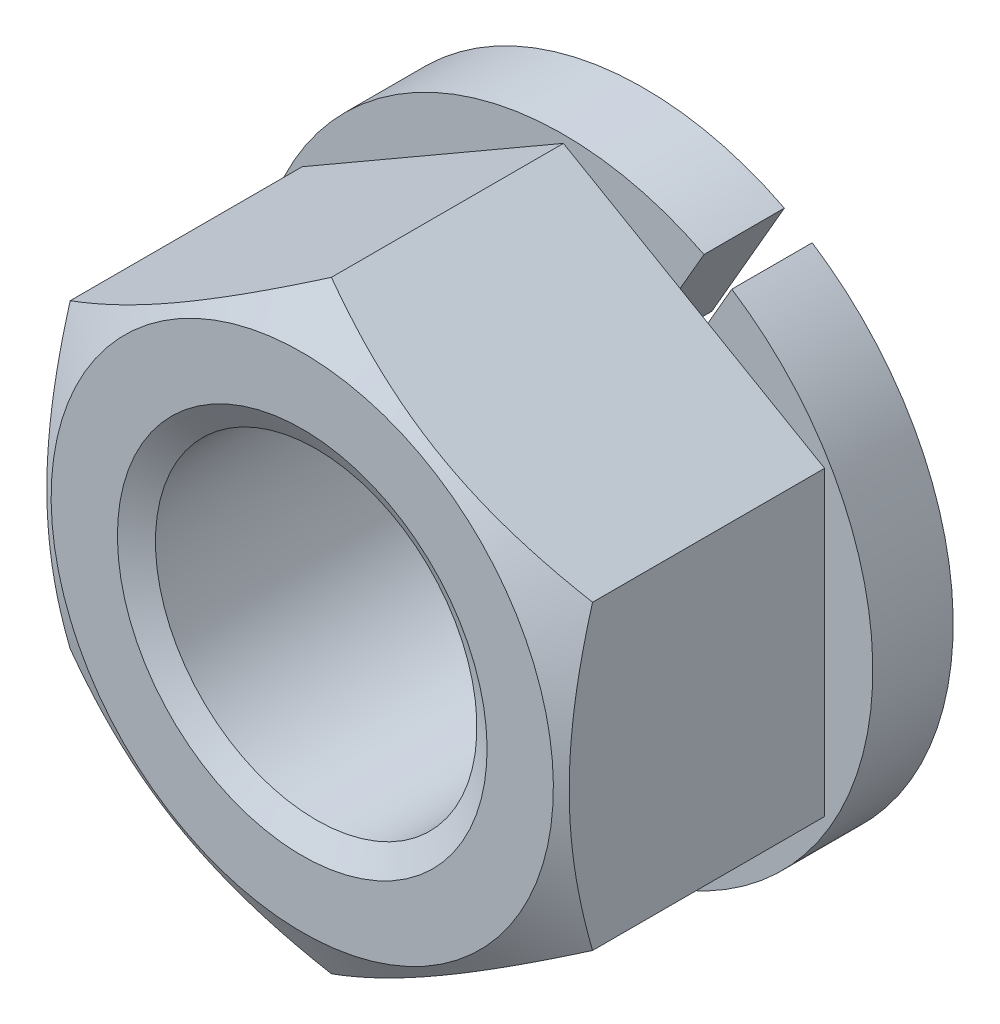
ISO-10303-21;
HEADER;
FILE_DESCRIPTION(('STEP AP214'),'2;1');
FILE_NAME('part.step','',(''),(''),'','','');
FILE_SCHEMA(('AUTOMOTIVE_DESIGN { 1 0 10303 214 1 1 1 1 }'));
ENDSEC;
DATA;
#1=APPLICATION_CONTEXT('core data for automotive mechanical design processes');
#2=APPLICATION_PROTOCOL_DEFINITION('international standard','automotive_design',2000,#1);
#3=PRODUCT_CONTEXT('',#1,'mechanical');
#4=PRODUCT('Part','Part','',(#3));
#5=PRODUCT_RELATED_PRODUCT_CATEGORY('part','',(#4));
#6=PRODUCT_DEFINITION_FORMATION('','',#4);
#7=PRODUCT_DEFINITION_CONTEXT('part definition',#1,'design');
#8=PRODUCT_DEFINITION('design','',#6,#7);
#9=PRODUCT_DEFINITION_SHAPE('','',#8);
#10=(LENGTH_UNIT() NAMED_UNIT(*) SI_UNIT(.MILLI.,.METRE.));
#11=(NAMED_UNIT(*) PLANE_ANGLE_UNIT() SI_UNIT($,.RADIAN.));
#12=(NAMED_UNIT(*) SI_UNIT($,.STERADIAN.) SOLID_ANGLE_UNIT());
#13=UNCERTAINTY_MEASURE_WITH_UNIT(LENGTH_MEASURE(1.E-05),#10,'distance_accuracy_value','');
#14=(GEOMETRIC_REPRESENTATION_CONTEXT(3) GLOBAL_UNCERTAINTY_ASSIGNED_CONTEXT((#13)) GLOBAL_UNIT_ASSIGNED_CONTEXT((#10,
#11,#12)) REPRESENTATION_CONTEXT('',''));
#15=CARTESIAN_POINT('',(0.,0.,0.));
#16=DIRECTION('',(0.,0.,1.));
#17=DIRECTION('',(1.,0.,0.));
#18=AXIS2_PLACEMENT_3D('',#15,#16,#17);
#19=CARTESIAN_POINT('',(13.,0.,2.));
#20=DIRECTION('',(0.,0.,1.));
#21=DIRECTION('',(-0.866025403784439,0.5,0.));
#22=AXIS2_PLACEMENT_3D('',#19,#20,#21);
#23=PLANE('',#22);
#24=CARTESIAN_POINT('',(0.,0.,2.));
#25=DIRECTION('',(0.,0.,1.));
#26=DIRECTION('',(0.866025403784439,-0.5,0.));
#27=AXIS2_PLACEMENT_3D('',#24,#25,#26);
#28=CIRCLE('',#27,4.);
#29=CARTESIAN_POINT('',(3.46410161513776,-2.,2.));
#30=VERTEX_POINT('',#29);
#31=EDGE_CURVE('E125',#30,#30,#28,.T.);
#32=ORIENTED_EDGE('',*,*,#31,.T.);
#33=EDGE_LOOP('',(#32));
#34=FACE_BOUND('',#33,.T.);
#35=DIRECTION('',(0.5,0.866025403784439,0.));
#36=VECTOR('',#35,1.);
#37=CARTESIAN_POINT('',(2.38663073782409,3.33376569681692,2.));
#38=LINE('',#37,#36);
#39=CARTESIAN_POINT('',(2.38663073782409,3.33376569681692,2.));
#40=VERTEX_POINT('',#39);
#41=CARTESIAN_POINT('',(3.59641016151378,5.42916512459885,2.));
#42=VERTEX_POINT('',#41);
#43=EDGE_CURVE('E9',#40,#42,#38,.T.);
#44=ORIENTED_EDGE('',*,*,#43,.F.);
#45=CARTESIAN_POINT('',(0.,0.,2.));
#46=DIRECTION('',(0.,0.,1.));
#47=DIRECTION('',(-0.866025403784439,0.5,0.));
#48=AXIS2_PLACEMENT_3D('',#45,#46,#47);
#49=CIRCLE('',#48,4.1);
#50=CARTESIAN_POINT('',(1.69381041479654,3.73376569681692,2.));
#51=VERTEX_POINT('',#50);
#52=EDGE_CURVE('E24',#51,#40,#49,.T.);
#53=ORIENTED_EDGE('',*,*,#52,.F.);
#54=DIRECTION('',(-0.5,-0.866025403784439,0.));
#55=VECTOR('',#54,1.);
#56=CARTESIAN_POINT('',(1.69381041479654,3.73376569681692,2.));
#57=LINE('',#56,#55);
#58=CARTESIAN_POINT('',(2.90358983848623,5.82916512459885,2.));
#59=VERTEX_POINT('',#58);
#60=EDGE_CURVE('E39',#59,#51,#57,.T.);
#61=ORIENTED_EDGE('',*,*,#60,.F.);
#62=DIRECTION('',(-0.866025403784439,0.5,0.));
#63=VECTOR('',#62,1.);
#64=CARTESIAN_POINT('',(6.5,3.75277674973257,2.));
#65=LINE('',#64,#63);
#66=EDGE_CURVE('E267',#42,#59,#65,.T.);
#67=ORIENTED_EDGE('',*,*,#66,.F.);
#68=EDGE_LOOP('',(#44,#53,#61,#67));
#69=FACE_BOUND('',#68,.T.);
#70=ADVANCED_FACE('F14',(#34,#69),#23,.F.);
#71=CARTESIAN_POINT('',(0.,-7.50555349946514,8.5));
#72=DIRECTION('',(-0.5,0.866025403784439,0.));
#73=DIRECTION('',(-0.866025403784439,-0.5,0.));
#74=AXIS2_PLACEMENT_3D('',#71,#72,#73);
#75=PLANE('',#74);
#76=CARTESIAN_POINT('',(-0.000199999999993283,-7.50566896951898,7.77503918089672));
#77=CARTESIAN_POINT('',(0.142677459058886,-7.4231786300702,7.8226580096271));
#78=CARTESIAN_POINT('',(0.286087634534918,-7.34038072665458,7.86811573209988));
#79=CARTESIAN_POINT('',(0.5740726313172,-7.17411251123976,7.95411375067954));
#80=CARTESIAN_POINT('',(0.718647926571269,-7.09064192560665,7.99465192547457));
#81=CARTESIAN_POINT('',(1.15468865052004,-6.83889369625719,8.10809143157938));
#82=CARTESIAN_POINT('',(1.44787528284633,-6.66962231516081,8.17261462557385));
#83=CARTESIAN_POINT('',(1.88662374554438,-6.41631077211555,8.2482758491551));
#84=CARTESIAN_POINT('',(2.0308746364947,-6.33302748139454,8.2698295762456));
#85=CARTESIAN_POINT('',(2.3200282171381,-6.16608458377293,8.30597211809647));
#86=CARTESIAN_POINT('',(2.4649308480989,-6.08242501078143,8.32056154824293));
#87=CARTESIAN_POINT('',(2.75498777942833,-5.91496056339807,8.34240368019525));
#88=CARTESIAN_POINT('',(2.90014160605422,-5.8311559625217,8.34966470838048));
#89=CARTESIAN_POINT('',(3.19057533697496,-5.66347396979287,8.35670213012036));
#90=CARTESIAN_POINT('',(3.33585523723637,-5.5795965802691,8.35647875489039));
#91=CARTESIAN_POINT('',(3.7338759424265,-5.34979921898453,8.34557897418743));
#92=CARTESIAN_POINT('',(3.98648646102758,-5.20395446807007,8.32728061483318));
#93=CARTESIAN_POINT('',(4.49002967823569,-4.91323365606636,8.26925609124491));
#94=CARTESIAN_POINT('',(4.74096060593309,-4.76835861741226,8.22951009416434));
#95=CARTESIAN_POINT('',(5.24551722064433,-4.47705272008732,8.13015652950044));
#96=CARTESIAN_POINT('',(5.49907924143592,-4.33065861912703,8.07012800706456));
#97=CARTESIAN_POINT('',(6.00242193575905,-4.04005357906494,7.93388744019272));
#98=CARTESIAN_POINT('',(6.25220905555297,-3.89583891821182,7.85770739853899));
#99=CARTESIAN_POINT('',(6.5002,-3.75266127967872,7.77503918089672));
#100=B_SPLINE_CURVE_WITH_KNOTS('',3,(#76,#77,#78,#79,#80,#81,#82,#83,#84,#85,#86,#87,#88,#89,
#90,#91,#92,#93,#94,#95,#96,#97,#98,#99),.UNSPECIFIED.,.F.,.F.,(4,2,2,2,2,2,2,2,2,2,2,4),(0.,
0.515105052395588,1.03043143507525,2.06322554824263,2.56697389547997,3.07067772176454,
3.57380860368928,4.07692394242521,4.95279354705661,5.82947446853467,6.72559912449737,
7.61996451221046),.UNSPECIFIED.);
#101=CARTESIAN_POINT('',(0.,-7.50555349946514,7.77510584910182));
#102=VERTEX_POINT('',#101);
#103=CARTESIAN_POINT('',(6.5,-3.75277674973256,7.77510584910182));
#104=VERTEX_POINT('',#103);
#105=EDGE_CURVE('E204',#102,#104,#100,.T.);
#106=ORIENTED_EDGE('',*,*,#105,.F.);
#107=DIRECTION('',(0.,0.,-1.));
#108=VECTOR('',#107,1.);
#109=CARTESIAN_POINT('',(0.,-7.50555349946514,8.5));
#110=LINE('',#109,#108);
#111=CARTESIAN_POINT('',(0.,-7.50555349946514,2.));
#112=VERTEX_POINT('',#111);
#113=EDGE_CURVE('E278',#102,#112,#110,.T.);
#114=ORIENTED_EDGE('',*,*,#113,.T.);
#115=DIRECTION('',(0.866025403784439,0.5,0.));
#116=VECTOR('',#115,1.);
#117=CARTESIAN_POINT('',(0.,-7.50555349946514,2.));
#118=LINE('',#117,#116);
#119=CARTESIAN_POINT('',(6.5,-3.75277674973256,2.));
#120=VERTEX_POINT('',#119);
#121=EDGE_CURVE('E298',#112,#120,#118,.T.);
#122=ORIENTED_EDGE('',*,*,#121,.T.);
#123=DIRECTION('',(0.,0.,-1.));
#124=VECTOR('',#123,1.);
#125=CARTESIAN_POINT('',(6.5,-3.75277674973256,8.5));
#126=LINE('',#125,#124);
#127=EDGE_CURVE('E291',#104,#120,#126,.T.);
#128=ORIENTED_EDGE('',*,*,#127,.F.);
#129=EDGE_LOOP('',(#106,#114,#122,#128));
#130=FACE_BOUND('',#129,.T.);
#131=ADVANCED_FACE('F16',(#130),#75,.F.);
#132=CARTESIAN_POINT('',(6.5,-3.75277674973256,8.5));
#133=DIRECTION('',(-1.,0.,0.));
#134=DIRECTION('',(0.,-1.,0.));
#135=AXIS2_PLACEMENT_3D('',#132,#133,#134);
#136=PLANE('',#135);
#137=CARTESIAN_POINT('',(6.5,-3.75300768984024,7.77503918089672));
#138=CARTESIAN_POINT('',(6.5,-3.58802701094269,7.8226580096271));
#139=CARTESIAN_POINT('',(6.5,-3.42243120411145,7.86811573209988));
#140=CARTESIAN_POINT('',(6.5,-3.08989477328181,7.95411375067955));
#141=CARTESIAN_POINT('',(6.5,-2.92295360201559,7.99465192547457));
#142=CARTESIAN_POINT('',(6.5,-2.41945714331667,8.10809143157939));
#143=CARTESIAN_POINT('',(6.5,-2.08091438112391,8.17261462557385));
#144=CARTESIAN_POINT('',(6.5,-1.5742912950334,8.2482758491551));
#145=CARTESIAN_POINT('',(6.5,-1.40772471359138,8.26982957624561));
#146=CARTESIAN_POINT('',(6.5,-1.07383891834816,8.30597211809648));
#147=CARTESIAN_POINT('',(6.5,-0.906519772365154,8.32056154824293));
#148=CARTESIAN_POINT('',(6.5,-0.571590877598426,8.34240368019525));
#149=CARTESIAN_POINT('',(6.5,-0.403981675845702,8.34966470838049));
#150=CARTESIAN_POINT('',(6.5,-0.0686176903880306,8.35670213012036));
#151=CARTESIAN_POINT('',(6.5,0.099137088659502,8.35647875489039));
#152=CARTESIAN_POINT('',(6.5,0.558731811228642,8.34557897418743));
#153=CARTESIAN_POINT('',(6.5,0.850421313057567,8.32728061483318));
#154=CARTESIAN_POINT('',(6.5,1.43186293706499,8.26925609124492));
#155=CARTESIAN_POINT('',(6.5,1.72161301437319,8.22951009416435));
#156=CARTESIAN_POINT('',(6.5,2.30422480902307,8.13015652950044));
#157=CARTESIAN_POINT('',(6.5,2.59701301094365,8.07012800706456));
#158=CARTESIAN_POINT('',(6.5,3.17822309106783,7.93388744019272));
#159=CARTESIAN_POINT('',(6.5,3.46665241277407,7.857707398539));
#160=CARTESIAN_POINT('',(6.5,3.75300768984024,7.77503918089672));
#161=B_SPLINE_CURVE_WITH_KNOTS('',3,(#137,#138,#139,#140,#141,#142,#143,#144,#145,#146,#147,
#148,#149,#150,#151,#152,#153,#154,#155,#156,#157,#158,#159,#160),.UNSPECIFIED.,.F.,.F.,(4,2,2,
2,2,2,2,2,2,2,2,4),(0.,0.515105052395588,1.03043143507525,2.06322554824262,2.56697389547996,
3.07067772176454,3.57380860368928,4.0769239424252,4.9527935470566,5.82947446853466,
6.72559912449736,7.61996451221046),.UNSPECIFIED.);
#162=CARTESIAN_POINT('',(6.5,3.75277674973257,7.77510584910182));
#163=VERTEX_POINT('',#162);
#164=EDGE_CURVE('E198',#104,#163,#161,.T.);
#165=ORIENTED_EDGE('',*,*,#164,.F.);
#166=ORIENTED_EDGE('',*,*,#127,.T.);
#167=DIRECTION('',(0.,1.,0.));
#168=VECTOR('',#167,1.);
#169=CARTESIAN_POINT('',(6.5,-3.75277674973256,2.));
#170=LINE('',#169,#168);
#171=CARTESIAN_POINT('',(6.5,3.75277674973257,2.));
#172=VERTEX_POINT('',#171);
#173=EDGE_CURVE('E270',#120,#172,#170,.T.);
#174=ORIENTED_EDGE('',*,*,#173,.T.);
#175=DIRECTION('',(0.,0.,-1.));
#176=VECTOR('',#175,1.);
#177=CARTESIAN_POINT('',(6.5,3.75277674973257,8.5));
#178=LINE('',#177,#176);
#179=EDGE_CURVE('E290',#163,#172,#178,.T.);
#180=ORIENTED_EDGE('',*,*,#179,.F.);
#181=EDGE_LOOP('',(#165,#166,#174,#180));
#182=FACE_BOUND('',#181,.T.);
#183=ADVANCED_FACE('F210',(#182),#136,.F.);
#184=CARTESIAN_POINT('',(6.5,3.75277674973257,8.5));
#185=DIRECTION('',(-0.5,-0.866025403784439,0.));
#186=DIRECTION('',(0.866025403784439,-0.5,0.));
#187=AXIS2_PLACEMENT_3D('',#184,#185,#186);
#188=PLANE('',#187);
#189=CARTESIAN_POINT('',(12.0032073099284,0.575498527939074,5.17042351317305));
#190=CARTESIAN_POINT('',(11.7571068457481,0.717584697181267,5.3083805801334));
#191=CARTESIAN_POINT('',(11.5104438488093,0.859995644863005,5.4450224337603));
#192=CARTESIAN_POINT('',(11.0156936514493,1.14563980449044,5.71493638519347));
#193=CARTESIAN_POINT('',(10.7676062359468,1.28887314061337,5.8482079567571));
#194=CARTESIAN_POINT('',(10.2684414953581,1.57706603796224,6.11130647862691));
#195=CARTESIAN_POINT('',(10.0173552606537,1.7220307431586,6.24111096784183));
#196=CARTESIAN_POINT('',(9.5131933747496,2.01310874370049,6.49544224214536));
#197=CARTESIAN_POINT('',(9.2601178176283,2.15922198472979,6.61996927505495));
#198=CARTESIAN_POINT('',(8.74340270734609,2.45754759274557,6.86624792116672));
#199=CARTESIAN_POINT('',(8.47968493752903,2.60980511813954,6.98778190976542));
#200=CARTESIAN_POINT('',(7.94917271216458,2.91609649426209,7.22171663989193));
#201=CARTESIAN_POINT('',(7.68237791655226,3.07013054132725,7.33411636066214));
#202=CARTESIAN_POINT('',(7.14577964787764,3.37993569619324,7.54685263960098));
#203=CARTESIAN_POINT('',(6.87598343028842,3.53570261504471,7.64721336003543));
#204=CARTESIAN_POINT('',(6.33251851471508,3.84947223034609,7.83266836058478));
#205=CARTESIAN_POINT('',(6.05885105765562,4.00747421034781,7.91776741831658));
#206=CARTESIAN_POINT('',(5.5089807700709,4.32494196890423,8.06819586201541));
#207=CARTESIAN_POINT('',(5.23279985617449,4.48439509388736,8.13363036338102));
#208=CARTESIAN_POINT('',(4.6769409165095,4.80532040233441,8.24101668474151));
#209=CARTESIAN_POINT('',(4.3972632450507,4.96679238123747,8.28297086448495));
#210=CARTESIAN_POINT('',(3.97809829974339,5.2087973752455,8.3255073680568));
#211=CARTESIAN_POINT('',(3.83935229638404,5.288902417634,8.33628152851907));
#212=CARTESIAN_POINT('',(3.56158385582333,5.44927210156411,8.35104952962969));
#213=CARTESIAN_POINT('',(3.42256142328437,5.52953674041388,8.35504348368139));
#214=CARTESIAN_POINT('',(3.1444951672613,5.69007836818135,8.35614824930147));
#215=CARTESIAN_POINT('',(3.00545134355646,5.77035535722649,8.35325898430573));
#216=CARTESIAN_POINT('',(2.72759296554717,5.93077696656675,8.34067016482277));
#217=CARTESIAN_POINT('',(2.58877842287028,6.01092158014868,8.33097027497));
#218=CARTESIAN_POINT('',(2.25594392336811,6.20308366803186,8.29975317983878));
#219=CARTESIAN_POINT('',(2.06214302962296,6.31497466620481,8.27505447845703));
#220=CARTESIAN_POINT('',(1.67597276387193,6.5379301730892,8.21372208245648));
#221=CARTESIAN_POINT('',(1.48360358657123,6.64899456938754,8.17708679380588));
#222=CARTESIAN_POINT('',(0.908873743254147,6.98081499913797,8.05121805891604));
#223=CARTESIAN_POINT('',(0.529096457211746,7.20007951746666,7.94604359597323));
#224=CARTESIAN_POINT('',(-0.0389508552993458,7.52804178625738,7.76351652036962));
#225=CARTESIAN_POINT('',(-0.23016156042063,7.63843733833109,7.69766406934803));
#226=CARTESIAN_POINT('',(-0.610725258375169,7.85815589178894,7.55908981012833));
#227=CARTESIAN_POINT('',(-0.800078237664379,7.96747888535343,7.48636795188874));
#228=CARTESIAN_POINT('',(-1.17698763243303,8.18508762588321,7.33522446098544));
#229=CARTESIAN_POINT('',(-1.36454459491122,8.29337368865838,7.25680463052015));
#230=CARTESIAN_POINT('',(-1.7381006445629,8.50904637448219,7.09519111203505));
#231=CARTESIAN_POINT('',(-1.92409976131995,8.6164330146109,7.0119975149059));
#232=CARTESIAN_POINT('',(-2.40662811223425,8.8950208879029,6.79019010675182));
#233=CARTESIAN_POINT('',(-2.70207718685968,9.06559849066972,6.64844687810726));
#234=CARTESIAN_POINT('',(-3.29011389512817,9.40510164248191,6.3572299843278));
#235=CARTESIAN_POINT('',(-3.58270126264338,9.57402703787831,6.20775560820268));
#236=CARTESIAN_POINT('',(-4.1656381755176,9.91058582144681,5.90283097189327));
#237=CARTESIAN_POINT('',(-4.45598696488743,10.0782187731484,5.7473787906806));
#238=CARTESIAN_POINT('',(-5.03478301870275,10.4123868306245,5.43186644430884));
#239=CARTESIAN_POINT('',(-5.32323034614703,10.5789219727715,5.27180643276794));
#240=CARTESIAN_POINT('',(-5.89899259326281,10.911338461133,4.94781528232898));
#241=CARTESIAN_POINT('',(-6.18630532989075,11.0772185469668,4.78387898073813));
#242=CARTESIAN_POINT('',(-6.759663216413,11.4082468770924,4.45307663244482));
#243=CARTESIAN_POINT('',(-7.04570835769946,11.5733951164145,4.28621056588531));
#244=CARTESIAN_POINT('',(-7.90217604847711,12.0678769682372,3.78214403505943));
#245=CARTESIAN_POINT('',(-8.47103978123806,12.396310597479,3.44141338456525));
#246=CARTESIAN_POINT('',(-9.54964259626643,13.0190422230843,2.78765146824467));
#247=CARTESIAN_POINT('',(-10.0596557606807,13.3134984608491,2.47522030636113));
#248=CARTESIAN_POINT('',(-11.0779401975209,13.9014052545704,1.8465250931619));
#249=CARTESIAN_POINT('',(-11.5862113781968,14.194855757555,1.53026084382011));
#250=CARTESIAN_POINT('',(-12.599878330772,14.7800966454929,0.895833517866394));
#251=CARTESIAN_POINT('',(-13.1052781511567,15.0718893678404,0.577679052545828));
#252=CARTESIAN_POINT('',(-14.1149864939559,15.6548447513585,-0.0608358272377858));
#253=CARTESIAN_POINT('',(-14.6192950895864,15.9460074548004,-0.381196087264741));
#254=CARTESIAN_POINT('',(-15.1232151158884,16.2369458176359,-0.702364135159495));
#255=B_SPLINE_CURVE_WITH_KNOTS('',3,(#189,#190,#191,#192,#193,#194,#195,#196,#197,#198,#199,
#200,#201,#202,#203,#204,#205,#206,#207,#208,#209,#210,#211,#212,#213,#214,#215,#216,#217,#218,
#219,#220,#221,#222,#223,#224,#225,#226,#227,#228,#229,#230,#231,#232,#233,#234,#235,#236,#237,
#238,#239,#240,#241,#242,#243,#244,#245,#246,#247,#248,#249,#250,#251,#252,#253,#254),
.UNSPECIFIED.,.F.,.F.,(4,2,2,2,2,2,2,2,2,2,2,2,2,2,2,2,2,2,2,2,2,2,2,2,2,2,2,2,2,2,2,2,4),(0.,
0.947679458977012,1.8955059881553,2.8484457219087,3.80134065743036,4.78484295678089,
5.76845501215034,6.750058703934,7.73135456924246,8.70730766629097,9.68316266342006,
10.1647568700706,10.6463430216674,11.1279345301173,11.6095497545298,12.2845918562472,
12.9597241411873,14.3107010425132,15.0018498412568,15.6930036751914,16.3839398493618,
17.0748628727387,18.1830119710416,19.2912631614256,20.399873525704,21.5084469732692,
22.6185908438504,23.7287422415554,25.9486246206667,27.9485800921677,29.9486393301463,
31.9426623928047,33.9365472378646),.UNSPECIFIED.);
#256=CARTESIAN_POINT('',(0.,7.50555349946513,7.77510584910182));
#257=VERTEX_POINT('',#256);
#258=EDGE_CURVE('E192',#163,#257,#255,.T.);
#259=ORIENTED_EDGE('',*,*,#258,.F.);
#260=ORIENTED_EDGE('',*,*,#179,.T.);
#261=EDGE_CURVE('E265',#172,#42,#65,.T.);
#262=ORIENTED_EDGE('',*,*,#261,.T.);
#263=ORIENTED_EDGE('',*,*,#66,.T.);
#264=CARTESIAN_POINT('',(0.,7.50555349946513,2.));
#265=VERTEX_POINT('',#264);
#266=EDGE_CURVE('E108',#59,#265,#65,.T.);
#267=ORIENTED_EDGE('',*,*,#266,.T.);
#268=DIRECTION('',(0.,0.,-1.));
#269=VECTOR('',#268,1.);
#270=CARTESIAN_POINT('',(0.,7.50555349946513,8.5));
#271=LINE('',#270,#269);
#272=EDGE_CURVE('E287',#257,#265,#271,.T.);
#273=ORIENTED_EDGE('',*,*,#272,.F.);
#274=EDGE_LOOP('',(#259,#260,#262,#263,#267,#273));
#275=FACE_BOUND('',#274,.T.);
#276=ADVANCED_FACE('F183',(#275),#188,.F.);
#277=CARTESIAN_POINT('',(0.,7.50555349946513,8.5));
#278=DIRECTION('',(0.5,-0.866025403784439,0.));
#279=DIRECTION('',(0.866025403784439,0.5,0.));
#280=AXIS2_PLACEMENT_3D('',#277,#278,#279);
#281=PLANE('',#280);
#282=CARTESIAN_POINT('',(0.000199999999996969,7.50566896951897,7.77503918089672));
#283=CARTESIAN_POINT('',(-0.142677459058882,7.42317863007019,7.82265800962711));
#284=CARTESIAN_POINT('',(-0.286087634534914,7.34038072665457,7.86811573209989));
#285=CARTESIAN_POINT('',(-0.574072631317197,7.17411251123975,7.95411375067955));
#286=CARTESIAN_POINT('',(-0.718647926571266,7.09064192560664,7.99465192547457));
#287=CARTESIAN_POINT('',(-1.15468865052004,6.83889369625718,8.10809143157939));
#288=CARTESIAN_POINT('',(-1.44787528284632,6.6696223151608,8.17261462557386));
#289=CARTESIAN_POINT('',(-1.88662374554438,6.41631077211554,8.2482758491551));
#290=CARTESIAN_POINT('',(-2.0308746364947,6.33302748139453,8.26982957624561));
#291=CARTESIAN_POINT('',(-2.3200282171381,6.16608458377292,8.30597211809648));
#292=CARTESIAN_POINT('',(-2.4649308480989,6.08242501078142,8.32056154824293));
#293=CARTESIAN_POINT('',(-2.75498777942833,5.91496056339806,8.34240368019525));
#294=CARTESIAN_POINT('',(-2.90014160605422,5.83115596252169,8.34966470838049));
#295=CARTESIAN_POINT('',(-3.19057533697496,5.66347396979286,8.35670213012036));
#296=CARTESIAN_POINT('',(-3.33585523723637,5.57959658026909,8.35647875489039));
#297=CARTESIAN_POINT('',(-3.7338759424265,5.34979921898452,8.34557897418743));
#298=CARTESIAN_POINT('',(-3.98648646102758,5.20395446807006,8.32728061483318));
#299=CARTESIAN_POINT('',(-4.49002967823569,4.91323365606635,8.26925609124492));
#300=CARTESIAN_POINT('',(-4.74096060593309,4.76835861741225,8.22951009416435));
#301=CARTESIAN_POINT('',(-5.24551722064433,4.47705272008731,8.13015652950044));
#302=CARTESIAN_POINT('',(-5.49907924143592,4.33065861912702,8.07012800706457));
#303=CARTESIAN_POINT('',(-6.00242193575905,4.04005357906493,7.93388744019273));
#304=CARTESIAN_POINT('',(-6.25220905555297,3.89583891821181,7.857707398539));
#305=CARTESIAN_POINT('',(-6.5002,3.75266127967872,7.77503918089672));
#306=B_SPLINE_CURVE_WITH_KNOTS('',3,(#282,#283,#284,#285,#286,#287,#288,#289,#290,#291,#292,
#293,#294,#295,#296,#297,#298,#299,#300,#301,#302,#303,#304,#305),.UNSPECIFIED.,.F.,.F.,(4,2,2,
2,2,2,2,2,2,2,2,4),(0.,0.51510505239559,1.03043143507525,2.06322554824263,2.56697389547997,
3.07067772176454,3.57380860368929,4.07692394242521,4.95279354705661,5.82947446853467,
6.72559912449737,7.61996451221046),.UNSPECIFIED.);
#307=CARTESIAN_POINT('',(-6.5,3.75277674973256,7.77510584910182));
#308=VERTEX_POINT('',#307);
#309=EDGE_CURVE('E186',#257,#308,#306,.T.);
#310=ORIENTED_EDGE('',*,*,#309,.F.);
#311=ORIENTED_EDGE('',*,*,#272,.T.);
#312=DIRECTION('',(-0.866025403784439,-0.5,0.));
#313=VECTOR('',#312,1.);
#314=CARTESIAN_POINT('',(0.,7.50555349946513,2.));
#315=LINE('',#314,#313);
#316=CARTESIAN_POINT('',(-6.5,3.75277674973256,2.));
#317=VERTEX_POINT('',#316);
#318=EDGE_CURVE('E269',#265,#317,#315,.T.);
#319=ORIENTED_EDGE('',*,*,#318,.T.);
#320=DIRECTION('',(0.,0.,-1.));
#321=VECTOR('',#320,1.);
#322=CARTESIAN_POINT('',(-6.5,3.75277674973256,8.5));
#323=LINE('',#322,#321);
#324=EDGE_CURVE('E284',#308,#317,#323,.T.);
#325=ORIENTED_EDGE('',*,*,#324,.F.);
#326=EDGE_LOOP('',(#310,#311,#319,#325));
#327=FACE_BOUND('',#326,.T.);
#328=ADVANCED_FACE('F178',(#327),#281,.F.);
#329=CARTESIAN_POINT('',(-6.5,3.75277674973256,8.5));
#330=DIRECTION('',(1.,0.,0.));
#331=DIRECTION('',(0.,1.,0.));
#332=AXIS2_PLACEMENT_3D('',#329,#330,#331);
#333=PLANE('',#332);
#334=CARTESIAN_POINT('',(-6.5,3.75300768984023,7.77503918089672));
#335=CARTESIAN_POINT('',(-6.5,3.58802701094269,7.82265800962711));
#336=CARTESIAN_POINT('',(-6.5,3.42243120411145,7.86811573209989));
#337=CARTESIAN_POINT('',(-6.5,3.0898947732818,7.95411375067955));
#338=CARTESIAN_POINT('',(-6.5,2.92295360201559,7.99465192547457));
#339=CARTESIAN_POINT('',(-6.5,2.41945714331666,8.10809143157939));
#340=CARTESIAN_POINT('',(-6.5,2.0809143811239,8.17261462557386));
#341=CARTESIAN_POINT('',(-6.5,1.57429129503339,8.2482758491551));
#342=CARTESIAN_POINT('',(-6.5,1.40772471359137,8.26982957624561));
#343=CARTESIAN_POINT('',(-6.5,1.07383891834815,8.30597211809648));
#344=CARTESIAN_POINT('',(-6.5,0.906519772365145,8.32056154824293));
#345=CARTESIAN_POINT('',(-6.5,0.571590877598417,8.34240368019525));
#346=CARTESIAN_POINT('',(-6.5,0.403981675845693,8.34966470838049));
#347=CARTESIAN_POINT('',(-6.5,0.0686176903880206,8.35670213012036));
#348=CARTESIAN_POINT('',(-6.5,-0.0991370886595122,8.35647875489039));
#349=CARTESIAN_POINT('',(-6.5,-0.558731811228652,8.34557897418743));
#350=CARTESIAN_POINT('',(-6.5,-0.850421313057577,8.32728061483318));
#351=CARTESIAN_POINT('',(-6.5,-1.431862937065,8.26925609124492));
#352=CARTESIAN_POINT('',(-6.5,-1.72161301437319,8.22951009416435));
#353=CARTESIAN_POINT('',(-6.5,-2.30422480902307,8.13015652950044));
#354=CARTESIAN_POINT('',(-6.5,-2.59701301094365,8.07012800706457));
#355=CARTESIAN_POINT('',(-6.5,-3.17822309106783,7.93388744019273));
#356=CARTESIAN_POINT('',(-6.5,-3.46665241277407,7.857707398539));
#357=CARTESIAN_POINT('',(-6.5,-3.75300768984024,7.77503918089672));
#358=B_SPLINE_CURVE_WITH_KNOTS('',3,(#334,#335,#336,#337,#338,#339,#340,#341,#342,#343,#344,
#345,#346,#347,#348,#349,#350,#351,#352,#353,#354,#355,#356,#357),.UNSPECIFIED.,.F.,.F.,(4,2,2,
2,2,2,2,2,2,2,2,4),(0.,0.515105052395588,1.03043143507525,2.06322554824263,2.56697389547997,
3.07067772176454,3.57380860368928,4.07692394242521,4.9527935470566,5.82947446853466,
6.72559912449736,7.61996451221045),.UNSPECIFIED.);
#359=CARTESIAN_POINT('',(-6.5,-3.75277674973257,7.77510584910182));
#360=VERTEX_POINT('',#359);
#361=EDGE_CURVE('E157',#308,#360,#358,.T.);
#362=ORIENTED_EDGE('',*,*,#361,.F.);
#363=ORIENTED_EDGE('',*,*,#324,.T.);
#364=DIRECTION('',(0.,-1.,0.));
#365=VECTOR('',#364,1.);
#366=CARTESIAN_POINT('',(-6.5,3.75277674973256,2.));
#367=LINE('',#366,#365);
#368=CARTESIAN_POINT('',(-6.5,-3.75277674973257,2.));
#369=VERTEX_POINT('',#368);
#370=EDGE_CURVE('E274',#317,#369,#367,.T.);
#371=ORIENTED_EDGE('',*,*,#370,.T.);
#372=DIRECTION('',(0.,0.,-1.));
#373=VECTOR('',#372,1.);
#374=CARTESIAN_POINT('',(-6.5,-3.75277674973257,8.5));
#375=LINE('',#374,#373);
#376=EDGE_CURVE('E281',#360,#369,#375,.T.);
#377=ORIENTED_EDGE('',*,*,#376,.F.);
#378=EDGE_LOOP('',(#362,#363,#371,#377));
#379=FACE_BOUND('',#378,.T.);
#380=ADVANCED_FACE('F172',(#379),#333,.F.);
#381=CARTESIAN_POINT('',(-6.5,-3.75277674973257,8.5));
#382=DIRECTION('',(0.5,0.866025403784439,0.));
#383=DIRECTION('',(-0.866025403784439,0.5,0.));
#384=AXIS2_PLACEMENT_3D('',#381,#382,#383);
#385=PLANE('',#384);
#386=CARTESIAN_POINT('',(5.50320730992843,-10.6828317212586,5.17042351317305));
#387=CARTESIAN_POINT('',(5.25710684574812,-10.5407455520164,5.3083805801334));
#388=CARTESIAN_POINT('',(5.01044384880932,-10.3983346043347,5.4450224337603));
#389=CARTESIAN_POINT('',(4.51569365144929,-10.1126904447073,5.71493638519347));
#390=CARTESIAN_POINT('',(4.26760623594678,-9.96945710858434,5.8482079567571));
#391=CARTESIAN_POINT('',(3.76844149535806,-9.68126421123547,6.11130647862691));
#392=CARTESIAN_POINT('',(3.51735526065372,-9.53629950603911,6.24111096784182));
#393=CARTESIAN_POINT('',(3.0131933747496,-9.24522150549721,6.49544224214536));
#394=CARTESIAN_POINT('',(2.76011781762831,-9.09910826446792,6.61996927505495));
#395=CARTESIAN_POINT('',(2.2434027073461,-8.80078265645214,6.86624792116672));
#396=CARTESIAN_POINT('',(1.97968493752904,-8.64852513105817,6.98778190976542));
#397=CARTESIAN_POINT('',(1.44917271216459,-8.34223375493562,7.22171663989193));
#398=CARTESIAN_POINT('',(1.18237791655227,-8.18819970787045,7.33411636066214));
#399=CARTESIAN_POINT('',(0.645779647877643,-7.87839455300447,7.54685263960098));
#400=CARTESIAN_POINT('',(0.375983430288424,-7.722627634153,7.64721336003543));
#401=CARTESIAN_POINT('',(-0.167481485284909,-7.40885801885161,7.83266836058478));
#402=CARTESIAN_POINT('',(-0.441148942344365,-7.2508560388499,7.91776741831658));
#403=CARTESIAN_POINT('',(-0.991019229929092,-6.93338828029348,8.06819586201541));
#404=CARTESIAN_POINT('',(-1.2672001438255,-6.77393515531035,8.13363036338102));
#405=CARTESIAN_POINT('',(-1.8230590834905,-6.45300984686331,8.24101668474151));
#406=CARTESIAN_POINT('',(-2.10273675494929,-6.29153786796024,8.28297086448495));
#407=CARTESIAN_POINT('',(-2.5219017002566,-6.04953287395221,8.3255073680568));
#408=CARTESIAN_POINT('',(-2.66064770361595,-5.96942783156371,8.33628152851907));
#409=CARTESIAN_POINT('',(-2.93841614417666,-5.8090581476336,8.3510495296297));
#410=CARTESIAN_POINT('',(-3.07743857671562,-5.72879350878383,8.35504348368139));
#411=CARTESIAN_POINT('',(-3.35550483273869,-5.56825188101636,8.35614824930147));
#412=CARTESIAN_POINT('',(-3.49454865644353,-5.48797489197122,8.35325898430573));
#413=CARTESIAN_POINT('',(-3.77240703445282,-5.32755328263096,8.34067016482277));
#414=CARTESIAN_POINT('',(-3.91122157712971,-5.24740866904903,8.33097027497));
#415=CARTESIAN_POINT('',(-4.24405607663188,-5.05524658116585,8.29975317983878));
#416=CARTESIAN_POINT('',(-4.43785697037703,-4.9433555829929,8.27505447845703));
#417=CARTESIAN_POINT('',(-4.82402723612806,-4.72040007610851,8.21372208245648));
#418=CARTESIAN_POINT('',(-5.01639641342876,-4.60933567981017,8.17708679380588));
#419=CARTESIAN_POINT('',(-5.59112625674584,-4.27751525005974,8.05121805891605));
#420=CARTESIAN_POINT('',(-5.97090354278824,-4.05825073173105,7.94604359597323));
#421=CARTESIAN_POINT('',(-6.53895085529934,-3.73028846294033,7.76351652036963));
#422=CARTESIAN_POINT('',(-6.73016156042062,-3.61989291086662,7.69766406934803));
#423=CARTESIAN_POINT('',(-7.11072525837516,-3.40017435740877,7.55908981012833));
#424=CARTESIAN_POINT('',(-7.30007823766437,-3.29085136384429,7.48636795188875));
#425=CARTESIAN_POINT('',(-7.67698763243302,-3.0732426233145,7.33522446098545));
#426=CARTESIAN_POINT('',(-7.86454459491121,-2.96495656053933,7.25680463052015));
#427=CARTESIAN_POINT('',(-8.23810064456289,-2.74928387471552,7.09519111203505));
#428=CARTESIAN_POINT('',(-8.42409976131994,-2.64189723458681,7.01199751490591));
#429=CARTESIAN_POINT('',(-8.90662811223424,-2.36330936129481,6.79019010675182));
#430=CARTESIAN_POINT('',(-9.20207718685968,-2.19273175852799,6.64844687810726));
#431=CARTESIAN_POINT('',(-9.79011389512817,-1.85322860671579,6.3572299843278));
#432=CARTESIAN_POINT('',(-10.0827012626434,-1.6843032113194,6.20775560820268));
#433=CARTESIAN_POINT('',(-10.6656381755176,-1.3477444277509,5.90283097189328));
#434=CARTESIAN_POINT('',(-10.9559869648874,-1.18011147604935,5.7473787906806));
#435=CARTESIAN_POINT('',(-11.5347830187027,-0.845943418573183,5.43186644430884));
#436=CARTESIAN_POINT('',(-11.823230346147,-0.679408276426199,5.27180643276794));
#437=CARTESIAN_POINT('',(-12.3989925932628,-0.34699178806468,4.94781528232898));
#438=CARTESIAN_POINT('',(-12.6863053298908,-0.181111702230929,4.78387898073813));
#439=CARTESIAN_POINT('',(-13.259663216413,0.149916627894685,4.45307663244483));
#440=CARTESIAN_POINT('',(-13.5457083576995,0.315064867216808,4.28621056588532));
#441=CARTESIAN_POINT('',(-14.4021760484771,0.809546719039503,3.78214403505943));
#442=CARTESIAN_POINT('',(-14.9710397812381,1.13798034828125,3.44141338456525));
#443=CARTESIAN_POINT('',(-16.0496425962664,1.76071197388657,2.78765146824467));
#444=CARTESIAN_POINT('',(-16.5596557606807,2.0551682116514,2.47522030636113));
#445=CARTESIAN_POINT('',(-17.5779401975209,2.64307500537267,1.8465250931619));
#446=CARTESIAN_POINT('',(-18.0862113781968,2.93652550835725,1.53026084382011));
#447=CARTESIAN_POINT('',(-19.099878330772,3.52176639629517,0.89583351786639));
#448=CARTESIAN_POINT('',(-19.6052781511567,3.81355911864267,0.577679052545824));
#449=CARTESIAN_POINT('',(-20.6149864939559,4.3965145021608,-0.0608358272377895));
#450=CARTESIAN_POINT('',(-21.1192950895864,4.68767720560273,-0.381196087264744));
#451=CARTESIAN_POINT('',(-21.6232151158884,4.97861556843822,-0.702364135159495));
#452=B_SPLINE_CURVE_WITH_KNOTS('',3,(#386,#387,#388,#389,#390,#391,#392,#393,#394,#395,#396,
#397,#398,#399,#400,#401,#402,#403,#404,#405,#406,#407,#408,#409,#410,#411,#412,#413,#414,#415,
#416,#417,#418,#419,#420,#421,#422,#423,#424,#425,#426,#427,#428,#429,#430,#431,#432,#433,#434,
#435,#436,#437,#438,#439,#440,#441,#442,#443,#444,#445,#446,#447,#448,#449,#450,#451),
.UNSPECIFIED.,.F.,.F.,(4,2,2,2,2,2,2,2,2,2,2,2,2,2,2,2,2,2,2,2,2,2,2,2,2,2,2,2,2,2,2,2,4),(0.,
0.947679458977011,1.8955059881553,2.8484457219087,3.80134065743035,4.78484295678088,
5.76845501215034,6.750058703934,7.73135456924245,8.70730766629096,9.68316266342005,
10.1647568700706,10.6463430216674,11.1279345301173,11.6095497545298,12.2845918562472,
12.9597241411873,14.3107010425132,15.0018498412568,15.6930036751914,16.3839398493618,
17.0748628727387,18.1830119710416,19.2912631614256,20.399873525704,21.5084469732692,
22.6185908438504,23.7287422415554,25.9486246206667,27.9485800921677,29.9486393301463,
31.9426623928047,33.9365472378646),.UNSPECIFIED.);
#453=EDGE_CURVE('E149',#360,#102,#452,.F.);
#454=ORIENTED_EDGE('',*,*,#453,.F.);
#455=ORIENTED_EDGE('',*,*,#376,.T.);
#456=DIRECTION('',(0.866025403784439,-0.5,0.));
#457=VECTOR('',#456,1.);
#458=CARTESIAN_POINT('',(-6.5,-3.75277674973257,2.));
#459=LINE('',#458,#457);
#460=EDGE_CURVE('E276',#369,#112,#459,.T.);
#461=ORIENTED_EDGE('',*,*,#460,.T.);
#462=ORIENTED_EDGE('',*,*,#113,.F.);
#463=EDGE_LOOP('',(#454,#455,#461,#462));
#464=FACE_BOUND('',#463,.T.);
#465=ADVANCED_FACE('F168',(#464),#385,.F.);
#466=CARTESIAN_POINT('',(0.,0.,8.5));
#467=DIRECTION('',(0.,0.,-1.));
#468=DIRECTION('',(0.866025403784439,-0.5,0.));
#469=AXIS2_PLACEMENT_3D('',#466,#467,#468);
#470=CONICAL_SURFACE('',#469,6.25,1.0471975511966);
#471=CARTESIAN_POINT('',(0.,0.,8.5));
#472=DIRECTION('',(0.,0.,1.));
#473=DIRECTION('',(-0.866025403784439,0.5,0.));
#474=AXIS2_PLACEMENT_3D('',#471,#472,#473);
#475=CIRCLE('',#474,6.25);
#476=CARTESIAN_POINT('',(-5.41265877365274,3.125,8.5));
#477=VERTEX_POINT('',#476);
#478=EDGE_CURVE('E146',#477,#477,#475,.T.);
#479=ORIENTED_EDGE('',*,*,#478,.F.);
#480=EDGE_LOOP('',(#479));
#481=FACE_BOUND('',#480,.T.);
#482=ORIENTED_EDGE('',*,*,#105,.T.);
#483=ORIENTED_EDGE('',*,*,#164,.T.);
#484=ORIENTED_EDGE('',*,*,#258,.T.);
#485=ORIENTED_EDGE('',*,*,#309,.T.);
#486=ORIENTED_EDGE('',*,*,#361,.T.);
#487=ORIENTED_EDGE('',*,*,#453,.T.);
#488=EDGE_LOOP('',(#482,#483,#484,#485,#486,#487));
#489=FACE_BOUND('',#488,.T.);
#490=ADVANCED_FACE('F164',(#481,#489),#470,.T.);
#491=CARTESIAN_POINT('',(13.,0.,8.5));
#492=DIRECTION('',(0.,0.,1.));
#493=DIRECTION('',(-0.866025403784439,0.5,0.));
#494=AXIS2_PLACEMENT_3D('',#491,#492,#493);
#495=PLANE('',#494);
#496=CARTESIAN_POINT('',(0.,0.,8.5));
#497=DIRECTION('',(0.,0.,1.));
#498=DIRECTION('',(-0.866025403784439,0.5,0.));
#499=AXIS2_PLACEMENT_3D('',#496,#497,#498);
#500=CIRCLE('',#499,4.6);
#501=CARTESIAN_POINT('',(-3.98371685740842,2.3,8.5));
#502=VERTEX_POINT('',#501);
#503=EDGE_CURVE('E118',#502,#502,#500,.T.);
#504=ORIENTED_EDGE('',*,*,#503,.F.);
#505=EDGE_LOOP('',(#504));
#506=FACE_BOUND('',#505,.T.);
#507=ORIENTED_EDGE('',*,*,#478,.T.);
#508=EDGE_LOOP('',(#507));
#509=FACE_BOUND('',#508,.T.);
#510=ADVANCED_FACE('F174',(#506,#509),#495,.T.);
#511=CARTESIAN_POINT('',(0.,0.,8.5));
#512=DIRECTION('',(0.,0.,1.));
#513=DIRECTION('',(-0.866025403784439,0.5,0.));
#514=AXIS2_PLACEMENT_3D('',#511,#512,#513);
#515=CONICAL_SURFACE('',#514,4.6,1.0471975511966);
#516=CARTESIAN_POINT('',(0.,0.,8.15358983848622));
#517=DIRECTION('',(0.,0.,1.));
#518=DIRECTION('',(0.866025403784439,-0.5,0.));
#519=AXIS2_PLACEMENT_3D('',#516,#517,#518);
#520=CIRCLE('',#519,4.);
#521=CARTESIAN_POINT('',(3.46410161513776,-2.,8.15358983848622));
#522=VERTEX_POINT('',#521);
#523=EDGE_CURVE('E19',#522,#522,#520,.F.);
#524=ORIENTED_EDGE('',*,*,#523,.T.);
#525=EDGE_LOOP('',(#524));
#526=FACE_BOUND('',#525,.T.);
#527=ORIENTED_EDGE('',*,*,#503,.T.);
#528=EDGE_LOOP('',(#527));
#529=FACE_BOUND('',#528,.T.);
#530=ADVANCED_FACE('F234',(#526,#529),#515,.F.);
#531=CARTESIAN_POINT('',(0.,0.,0.));
#532=DIRECTION('',(0.,0.,1.));
#533=DIRECTION('',(0.866025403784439,-0.5,0.));
#534=AXIS2_PLACEMENT_3D('',#531,#532,#533);
#535=CYLINDRICAL_SURFACE('',#534,7.7);
#536=CARTESIAN_POINT('',(0.,0.,2.));
#537=DIRECTION('',(0.,0.,-1.));
#538=DIRECTION('',(-0.866025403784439,0.5,0.));
#539=AXIS2_PLACEMENT_3D('',#536,#537,#538);
#540=CIRCLE('',#539,7.7);
#541=CARTESIAN_POINT('',(4.19121184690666,6.45939186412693,2.));
#542=VERTEX_POINT('',#541);
#543=CARTESIAN_POINT('',(3.49839152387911,6.85939186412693,2.));
#544=VERTEX_POINT('',#543);
#545=EDGE_CURVE('E107',#542,#544,#540,.T.);
#546=ORIENTED_EDGE('',*,*,#545,.T.);
#547=DIRECTION('',(0.,0.,1.));
#548=VECTOR('',#547,1.);
#549=CARTESIAN_POINT('',(3.49839152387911,6.85939186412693,0.));
#550=LINE('',#549,#548);
#551=CARTESIAN_POINT('',(3.49839152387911,6.85939186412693,0.));
#552=VERTEX_POINT('',#551);
#553=EDGE_CURVE('E112',#552,#544,#550,.T.);
#554=ORIENTED_EDGE('',*,*,#553,.F.);
#555=CARTESIAN_POINT('',(0.,0.,0.));
#556=DIRECTION('',(0.,0.,-1.));
#557=DIRECTION('',(-0.866025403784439,0.5,0.));
#558=AXIS2_PLACEMENT_3D('',#555,#556,#557);
#559=CIRCLE('',#558,7.7);
#560=CARTESIAN_POINT('',(4.19121184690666,6.45939186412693,0.));
#561=VERTEX_POINT('',#560);
#562=EDGE_CURVE('E131',#561,#552,#559,.T.);
#563=ORIENTED_EDGE('',*,*,#562,.F.);
#564=DIRECTION('',(0.,0.,1.));
#565=VECTOR('',#564,1.);
#566=CARTESIAN_POINT('',(4.19121184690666,6.45939186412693,0.));
#567=LINE('',#566,#565);
#568=EDGE_CURVE('E124',#561,#542,#567,.T.);
#569=ORIENTED_EDGE('',*,*,#568,.T.);
#570=EDGE_LOOP('',(#546,#554,#563,#569));
#571=FACE_BOUND('',#570,.T.);
#572=ADVANCED_FACE('F122',(#571),#535,.T.);
#573=CARTESIAN_POINT('',(0.,0.,0.));
#574=DIRECTION('',(0.,0.,-1.));
#575=DIRECTION('',(-0.866025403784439,0.5,0.));
#576=AXIS2_PLACEMENT_3D('',#573,#574,#575);
#577=PLANE('',#576);
#578=ORIENTED_EDGE('',*,*,#562,.T.);
#579=DIRECTION('',(-0.5,-0.866025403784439,0.));
#580=VECTOR('',#579,1.);
#581=CARTESIAN_POINT('',(1.69381041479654,3.73376569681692,0.));
#582=LINE('',#581,#580);
#583=CARTESIAN_POINT('',(1.69381041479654,3.73376569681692,0.));
#584=VERTEX_POINT('',#583);
#585=EDGE_CURVE('E114',#552,#584,#582,.T.);
#586=ORIENTED_EDGE('',*,*,#585,.T.);
#587=CARTESIAN_POINT('',(0.,0.,0.));
#588=DIRECTION('',(0.,0.,1.));
#589=DIRECTION('',(-0.866025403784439,0.5,0.));
#590=AXIS2_PLACEMENT_3D('',#587,#588,#589);
#591=CIRCLE('',#590,4.1);
#592=CARTESIAN_POINT('',(2.38663073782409,3.33376569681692,0.));
#593=VERTEX_POINT('',#592);
#594=EDGE_CURVE('E134',#584,#593,#591,.T.);
#595=ORIENTED_EDGE('',*,*,#594,.T.);
#596=DIRECTION('',(0.5,0.866025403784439,0.));
#597=VECTOR('',#596,1.);
#598=CARTESIAN_POINT('',(2.38663073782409,3.33376569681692,0.));
#599=LINE('',#598,#597);
#600=EDGE_CURVE('E136',#593,#561,#599,.T.);
#601=ORIENTED_EDGE('',*,*,#600,.T.);
#602=EDGE_LOOP('',(#578,#586,#595,#601));
#603=FACE_BOUND('',#602,.T.);
#604=ADVANCED_FACE('F238',(#603),#577,.T.);
#605=CARTESIAN_POINT('',(1.69381041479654,3.73376569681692,0.));
#606=DIRECTION('',(-0.866025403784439,0.5,0.));
#607=DIRECTION('',(0.5,0.866025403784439,0.));
#608=AXIS2_PLACEMENT_3D('',#605,#606,#607);
#609=PLANE('',#608);
#610=EDGE_CURVE('E101',#544,#59,#57,.T.);
#611=ORIENTED_EDGE('',*,*,#610,.T.);
#612=ORIENTED_EDGE('',*,*,#60,.T.);
#613=DIRECTION('',(0.,0.,1.));
#614=VECTOR('',#613,1.);
#615=CARTESIAN_POINT('',(1.69381041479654,3.73376569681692,0.));
#616=LINE('',#615,#614);
#617=EDGE_CURVE('E119',#584,#51,#616,.T.);
#618=ORIENTED_EDGE('',*,*,#617,.F.);
#619=ORIENTED_EDGE('',*,*,#585,.F.);
#620=ORIENTED_EDGE('',*,*,#553,.T.);
#621=EDGE_LOOP('',(#611,#612,#618,#619,#620));
#622=FACE_BOUND('',#621,.T.);
#623=ADVANCED_FACE('F113',(#622),#609,.F.);
#624=CARTESIAN_POINT('',(0.,0.,0.));
#625=DIRECTION('',(0.,0.,1.));
#626=DIRECTION('',(0.866025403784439,-0.5,0.));
#627=AXIS2_PLACEMENT_3D('',#624,#625,#626);
#628=CYLINDRICAL_SURFACE('',#627,4.1);
#629=ORIENTED_EDGE('',*,*,#52,.T.);
#630=DIRECTION('',(0.,0.,1.));
#631=VECTOR('',#630,1.);
#632=CARTESIAN_POINT('',(2.38663073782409,3.33376569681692,0.));
#633=LINE('',#632,#631);
#634=EDGE_CURVE('E139',#593,#40,#633,.T.);
#635=ORIENTED_EDGE('',*,*,#634,.F.);
#636=ORIENTED_EDGE('',*,*,#594,.F.);
#637=ORIENTED_EDGE('',*,*,#617,.T.);
#638=EDGE_LOOP('',(#629,#635,#636,#637));
#639=FACE_BOUND('',#638,.T.);
#640=ADVANCED_FACE('F235',(#639),#628,.F.);
#641=CARTESIAN_POINT('',(2.38663073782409,3.33376569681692,0.));
#642=DIRECTION('',(0.866025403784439,-0.5,0.));
#643=DIRECTION('',(-0.5,-0.866025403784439,0.));
#644=AXIS2_PLACEMENT_3D('',#641,#642,#643);
#645=PLANE('',#644);
#646=ORIENTED_EDGE('',*,*,#43,.T.);
#647=EDGE_CURVE('E26',#42,#542,#38,.T.);
#648=ORIENTED_EDGE('',*,*,#647,.T.);
#649=ORIENTED_EDGE('',*,*,#568,.F.);
#650=ORIENTED_EDGE('',*,*,#600,.F.);
#651=ORIENTED_EDGE('',*,*,#634,.T.);
#652=EDGE_LOOP('',(#646,#648,#649,#650,#651));
#653=FACE_BOUND('',#652,.T.);
#654=ADVANCED_FACE('F225',(#653),#645,.F.);
#655=CARTESIAN_POINT('',(0.,0.,2.));
#656=DIRECTION('',(0.,0.,-1.));
#657=DIRECTION('',(-0.866025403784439,0.5,0.));
#658=AXIS2_PLACEMENT_3D('',#655,#656,#657);
#659=PLANE('',#658);
#660=ORIENTED_EDGE('',*,*,#318,.F.);
#661=ORIENTED_EDGE('',*,*,#266,.F.);
#662=ORIENTED_EDGE('',*,*,#610,.F.);
#663=ORIENTED_EDGE('',*,*,#545,.F.);
#664=ORIENTED_EDGE('',*,*,#647,.F.);
#665=ORIENTED_EDGE('',*,*,#261,.F.);
#666=ORIENTED_EDGE('',*,*,#173,.F.);
#667=ORIENTED_EDGE('',*,*,#121,.F.);
#668=ORIENTED_EDGE('',*,*,#460,.F.);
#669=ORIENTED_EDGE('',*,*,#370,.F.);
#670=EDGE_LOOP('',(#660,#661,#662,#663,#664,#665,#666,#667,#668,#669));
#671=FACE_BOUND('',#670,.T.);
#672=ADVANCED_FACE('F104',(#671),#659,.F.);
#673=CARTESIAN_POINT('',(0.,0.,-1.5));
#674=DIRECTION('',(0.,0.,1.));
#675=DIRECTION('',(0.866025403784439,-0.5,0.));
#676=AXIS2_PLACEMENT_3D('',#673,#674,#675);
#677=CYLINDRICAL_SURFACE('',#676,4.);
#678=ORIENTED_EDGE('',*,*,#523,.F.);
#679=EDGE_LOOP('',(#678));
#680=FACE_BOUND('',#679,.T.);
#681=ORIENTED_EDGE('',*,*,#31,.F.);
#682=EDGE_LOOP('',(#681));
#683=FACE_BOUND('',#682,.T.);
#684=ADVANCED_FACE('F224',(#680,#683),#677,.F.);
#685=CLOSED_SHELL('',(#70,#131,#183,#276,#328,#380,#465,#490,#510,#530,#572,#604,#623,#640,#654,
#672,#684));
#686=MANIFOLD_SOLID_BREP('B1',#685);
#687=ADVANCED_BREP_SHAPE_REPRESENTATION('',(#18,#686),#14);
#688=SHAPE_DEFINITION_REPRESENTATION(#9,#687);
ENDSEC;
END-ISO-10303-21;
